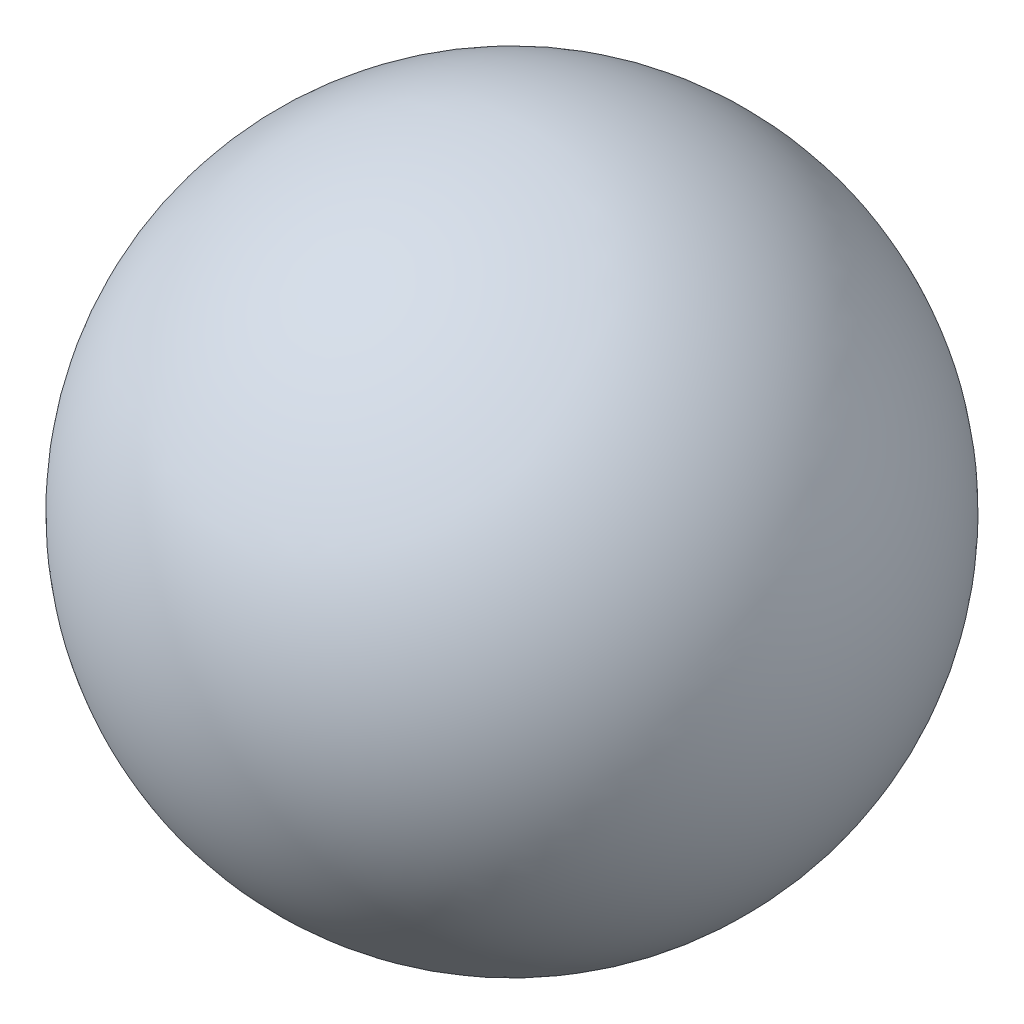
from build123d import *


with BuildPart() as part:
    # Sketch2 → Revolve1 (revolve)
    with BuildSketch(Plane(origin=(0, 0, 0), x_dir=(1, 0, 0), z_dir=(0, 1, 0))):
        with BuildLine():
            Line((0, 3.9624), (0, -3.9624))
            ThreePointArc((0, -3.9624), (3.9624, 0), (0, 3.9624))
        make_face()
    revolve(axis=Axis((0, 0, -28.855097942), (0, 0, 1)))


solid = part.part
